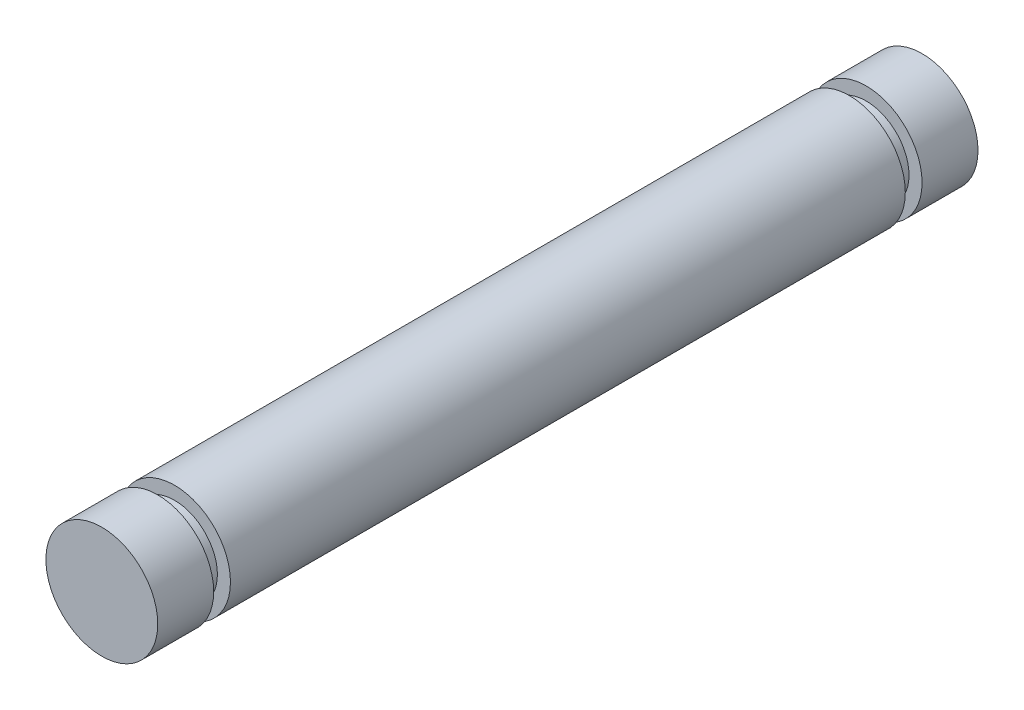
from build123d import *

# Parameters (mm, degrees)
ESQUISSE1_R             = 1.5
BASE_EXTRUSION_DEPTH    = 11
ESQUISSE2_R             = 1.5
ESQUISSE2_R_2           = 1.15
ENL_V_MAT_EXTRU_1_DEPTH = 0.45


with BuildPart() as part:
    # Esquisse1 → Base-Extrusion (new, symmetric)
    with BuildSketch(Plane.XY):
        with Locations((-14.75, 36)):
            Circle(ESQUISSE1_R)
    extrude(amount=BASE_EXTRUSION_DEPTH, both=True)

    # Esquisse2 → Enl_v. mat.-Extru.1 (cut)
    with BuildSketch(Plane.XY.offset(9.5)):
        with Locations((-14.75, 36)):
            Circle(ESQUISSE2_R)
        with Locations((-14.75, 36)):
            Circle(ESQUISSE2_R_2, mode=Mode.SUBTRACT)
    enl_v_mat_extru_1 = extrude(amount=-ENL_V_MAT_EXTRU_1_DEPTH, mode=Mode.SUBTRACT)

    # Sym_trie1: Enl_v. mat.-Extru.1 across plane
    add(enl_v_mat_extru_1.mirror(Plane.XY), mode=Mode.SUBTRACT)


solid = part.part
